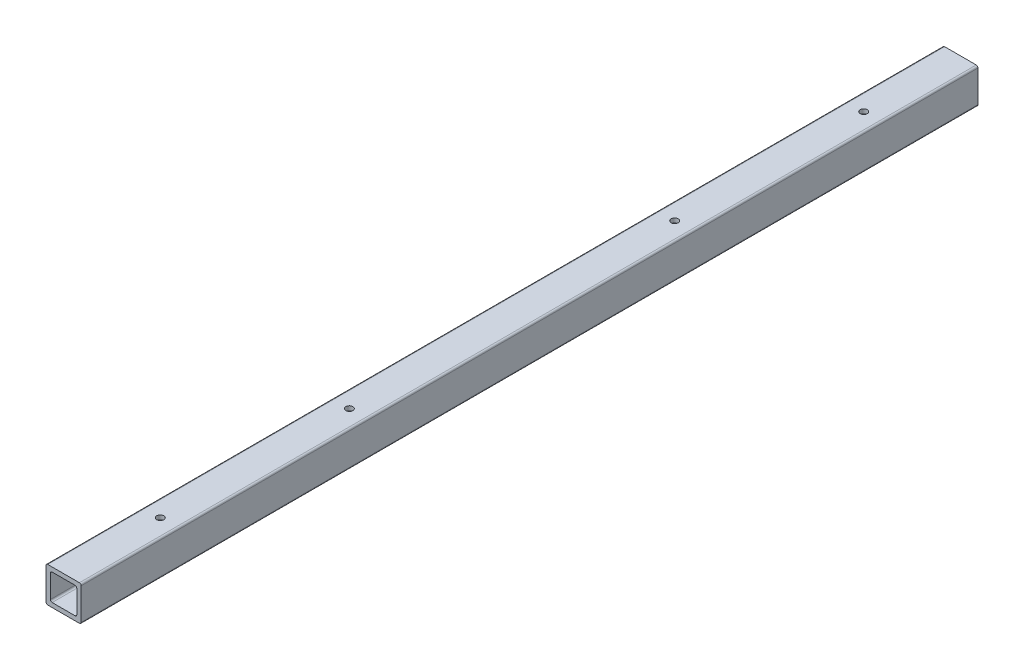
ISO-10303-21;
HEADER;
FILE_DESCRIPTION(('STEP AP214'),'2;1');
FILE_NAME('part.step','',(''),(''),'','','');
FILE_SCHEMA(('AUTOMOTIVE_DESIGN { 1 0 10303 214 1 1 1 1 }'));
ENDSEC;
DATA;
#1=APPLICATION_CONTEXT('core data for automotive mechanical design processes');
#2=APPLICATION_PROTOCOL_DEFINITION('international standard','automotive_design',2000,#1);
#3=PRODUCT_CONTEXT('',#1,'mechanical');
#4=PRODUCT('Part','Part','',(#3));
#5=PRODUCT_RELATED_PRODUCT_CATEGORY('part','',(#4));
#6=PRODUCT_DEFINITION_FORMATION('','',#4);
#7=PRODUCT_DEFINITION_CONTEXT('part definition',#1,'design');
#8=PRODUCT_DEFINITION('design','',#6,#7);
#9=PRODUCT_DEFINITION_SHAPE('','',#8);
#10=(LENGTH_UNIT() NAMED_UNIT(*) SI_UNIT(.MILLI.,.METRE.));
#11=(NAMED_UNIT(*) PLANE_ANGLE_UNIT() SI_UNIT($,.RADIAN.));
#12=(NAMED_UNIT(*) SI_UNIT($,.STERADIAN.) SOLID_ANGLE_UNIT());
#13=UNCERTAINTY_MEASURE_WITH_UNIT(LENGTH_MEASURE(1.E-05),#10,'distance_accuracy_value','');
#14=(GEOMETRIC_REPRESENTATION_CONTEXT(3) GLOBAL_UNCERTAINTY_ASSIGNED_CONTEXT((#13)) GLOBAL_UNIT_ASSIGNED_CONTEXT((#10,
#11,#12)) REPRESENTATION_CONTEXT('',''));
#15=CARTESIAN_POINT('',(0.,0.,0.));
#16=DIRECTION('',(0.,0.,1.));
#17=DIRECTION('',(1.,0.,0.));
#18=AXIS2_PLACEMENT_3D('',#15,#16,#17);
#19=CARTESIAN_POINT('',(-22.86,22.86,647.7));
#20=DIRECTION('',(0.,0.,-1.));
#21=DIRECTION('',(-1.,0.,0.));
#22=AXIS2_PLACEMENT_3D('',#19,#20,#21);
#23=PLANE('',#22);
#24=CARTESIAN_POINT('',(-22.86,22.86,647.7));
#25=DIRECTION('',(0.,0.,1.));
#26=DIRECTION('',(-1.,0.,0.));
#27=AXIS2_PLACEMENT_3D('',#24,#25,#26);
#28=CIRCLE('',#27,2.54);
#29=CARTESIAN_POINT('',(-22.86,25.4,647.7));
#30=VERTEX_POINT('',#29);
#31=CARTESIAN_POINT('',(-25.4,22.86,647.7));
#32=VERTEX_POINT('',#31);
#33=EDGE_CURVE('E236',#30,#32,#28,.T.);
#34=ORIENTED_EDGE('',*,*,#33,.T.);
#35=DIRECTION('',(0.,-1.,0.));
#36=VECTOR('',#35,1.);
#37=CARTESIAN_POINT('',(-25.4,-22.86,647.7));
#38=LINE('',#37,#36);
#39=CARTESIAN_POINT('',(-25.4,-22.86,647.7));
#40=VERTEX_POINT('',#39);
#41=EDGE_CURVE('E239',#32,#40,#38,.T.);
#42=ORIENTED_EDGE('',*,*,#41,.T.);
#43=CARTESIAN_POINT('',(-22.86,-22.86,647.7));
#44=DIRECTION('',(0.,0.,1.));
#45=DIRECTION('',(-1.,0.,0.));
#46=AXIS2_PLACEMENT_3D('',#43,#44,#45);
#47=CIRCLE('',#46,2.54);
#48=CARTESIAN_POINT('',(-22.86,-25.4,647.7));
#49=VERTEX_POINT('',#48);
#50=EDGE_CURVE('E241',#40,#49,#47,.T.);
#51=ORIENTED_EDGE('',*,*,#50,.T.);
#52=DIRECTION('',(1.,0.,0.));
#53=VECTOR('',#52,1.);
#54=CARTESIAN_POINT('',(-22.86,-25.4,647.7));
#55=LINE('',#54,#53);
#56=CARTESIAN_POINT('',(22.86,-25.4,647.7));
#57=VERTEX_POINT('',#56);
#58=EDGE_CURVE('E243',#49,#57,#55,.T.);
#59=ORIENTED_EDGE('',*,*,#58,.T.);
#60=CARTESIAN_POINT('',(22.86,-22.86,647.7));
#61=DIRECTION('',(0.,0.,1.));
#62=DIRECTION('',(-1.,0.,0.));
#63=AXIS2_PLACEMENT_3D('',#60,#61,#62);
#64=CIRCLE('',#63,2.54);
#65=CARTESIAN_POINT('',(25.4,-22.86,647.7));
#66=VERTEX_POINT('',#65);
#67=EDGE_CURVE('E245',#57,#66,#64,.T.);
#68=ORIENTED_EDGE('',*,*,#67,.T.);
#69=DIRECTION('',(0.,1.,0.));
#70=VECTOR('',#69,1.);
#71=CARTESIAN_POINT('',(25.4,-22.86,647.7));
#72=LINE('',#71,#70);
#73=CARTESIAN_POINT('',(25.4,22.86,647.7));
#74=VERTEX_POINT('',#73);
#75=EDGE_CURVE('E247',#66,#74,#72,.T.);
#76=ORIENTED_EDGE('',*,*,#75,.T.);
#77=CARTESIAN_POINT('',(22.86,22.86,647.7));
#78=DIRECTION('',(0.,0.,1.));
#79=DIRECTION('',(-1.,0.,0.));
#80=AXIS2_PLACEMENT_3D('',#77,#78,#79);
#81=CIRCLE('',#80,2.54);
#82=CARTESIAN_POINT('',(22.86,25.4,647.7));
#83=VERTEX_POINT('',#82);
#84=EDGE_CURVE('E249',#74,#83,#81,.T.);
#85=ORIENTED_EDGE('',*,*,#84,.T.);
#86=DIRECTION('',(-1.,0.,0.));
#87=VECTOR('',#86,1.);
#88=CARTESIAN_POINT('',(-22.86,25.4,647.7));
#89=LINE('',#88,#87);
#90=EDGE_CURVE('E251',#83,#30,#89,.T.);
#91=ORIENTED_EDGE('',*,*,#90,.T.);
#92=EDGE_LOOP('',(#34,#42,#51,#59,#68,#76,#85,#91));
#93=FACE_BOUND('',#92,.T.);
#94=CARTESIAN_POINT('',(16.51,16.51,647.7));
#95=DIRECTION('',(0.,0.,1.));
#96=DIRECTION('',(-1.,0.,0.));
#97=AXIS2_PLACEMENT_3D('',#94,#95,#96);
#98=CIRCLE('',#97,2.54);
#99=CARTESIAN_POINT('',(19.05,16.51,647.7));
#100=VERTEX_POINT('',#99);
#101=CARTESIAN_POINT('',(16.51,19.05,647.7));
#102=VERTEX_POINT('',#101);
#103=EDGE_CURVE('E166',#100,#102,#98,.T.);
#104=ORIENTED_EDGE('',*,*,#103,.F.);
#105=DIRECTION('',(0.,1.,0.));
#106=VECTOR('',#105,1.);
#107=CARTESIAN_POINT('',(19.05,-16.51,647.7));
#108=LINE('',#107,#106);
#109=CARTESIAN_POINT('',(19.05,-16.51,647.7));
#110=VERTEX_POINT('',#109);
#111=EDGE_CURVE('E206',#110,#100,#108,.T.);
#112=ORIENTED_EDGE('',*,*,#111,.F.);
#113=CARTESIAN_POINT('',(16.51,-16.51,647.7));
#114=DIRECTION('',(0.,0.,1.));
#115=DIRECTION('',(-1.,0.,0.));
#116=AXIS2_PLACEMENT_3D('',#113,#114,#115);
#117=CIRCLE('',#116,2.54);
#118=CARTESIAN_POINT('',(16.51,-19.05,647.7));
#119=VERTEX_POINT('',#118);
#120=EDGE_CURVE('E204',#119,#110,#117,.T.);
#121=ORIENTED_EDGE('',*,*,#120,.F.);
#122=DIRECTION('',(1.,0.,0.));
#123=VECTOR('',#122,1.);
#124=CARTESIAN_POINT('',(-16.51,-19.05,647.7));
#125=LINE('',#124,#123);
#126=CARTESIAN_POINT('',(-16.51,-19.05,647.7));
#127=VERTEX_POINT('',#126);
#128=EDGE_CURVE('E202',#127,#119,#125,.T.);
#129=ORIENTED_EDGE('',*,*,#128,.F.);
#130=CARTESIAN_POINT('',(-16.51,-16.51,647.7));
#131=DIRECTION('',(0.,0.,1.));
#132=DIRECTION('',(-1.,0.,0.));
#133=AXIS2_PLACEMENT_3D('',#130,#131,#132);
#134=CIRCLE('',#133,2.54);
#135=CARTESIAN_POINT('',(-19.05,-16.51,647.7));
#136=VERTEX_POINT('',#135);
#137=EDGE_CURVE('E200',#136,#127,#134,.T.);
#138=ORIENTED_EDGE('',*,*,#137,.F.);
#139=DIRECTION('',(0.,-1.,0.));
#140=VECTOR('',#139,1.);
#141=CARTESIAN_POINT('',(-19.05,-16.51,647.7));
#142=LINE('',#141,#140);
#143=CARTESIAN_POINT('',(-19.05,16.51,647.7));
#144=VERTEX_POINT('',#143);
#145=EDGE_CURVE('E198',#144,#136,#142,.T.);
#146=ORIENTED_EDGE('',*,*,#145,.F.);
#147=CARTESIAN_POINT('',(-16.51,16.51,647.7));
#148=DIRECTION('',(0.,0.,1.));
#149=DIRECTION('',(-1.,0.,0.));
#150=AXIS2_PLACEMENT_3D('',#147,#148,#149);
#151=CIRCLE('',#150,2.54);
#152=CARTESIAN_POINT('',(-16.51,19.05,647.7));
#153=VERTEX_POINT('',#152);
#154=EDGE_CURVE('E196',#153,#144,#151,.T.);
#155=ORIENTED_EDGE('',*,*,#154,.F.);
#156=DIRECTION('',(-1.,0.,0.));
#157=VECTOR('',#156,1.);
#158=CARTESIAN_POINT('',(-16.51,19.05,647.7));
#159=LINE('',#158,#157);
#160=EDGE_CURVE('E194',#102,#153,#159,.T.);
#161=ORIENTED_EDGE('',*,*,#160,.F.);
#162=EDGE_LOOP('',(#104,#112,#121,#129,#138,#146,#155,#161));
#163=FACE_BOUND('',#162,.T.);
#164=ADVANCED_FACE('F36',(#93,#163),#23,.F.);
#165=CARTESIAN_POINT('',(-22.86,22.86,-647.7));
#166=DIRECTION('',(0.,0.,-1.));
#167=DIRECTION('',(-1.,0.,0.));
#168=AXIS2_PLACEMENT_3D('',#165,#166,#167);
#169=PLANE('',#168);
#170=CARTESIAN_POINT('',(-22.86,22.86,-647.7));
#171=DIRECTION('',(0.,0.,1.));
#172=DIRECTION('',(-1.,0.,0.));
#173=AXIS2_PLACEMENT_3D('',#170,#171,#172);
#174=CIRCLE('',#173,2.54);
#175=CARTESIAN_POINT('',(-22.86,25.4,-647.7));
#176=VERTEX_POINT('',#175);
#177=CARTESIAN_POINT('',(-25.4,22.86,-647.7));
#178=VERTEX_POINT('',#177);
#179=EDGE_CURVE('E167',#176,#178,#174,.T.);
#180=ORIENTED_EDGE('',*,*,#179,.F.);
#181=DIRECTION('',(-1.,0.,0.));
#182=VECTOR('',#181,1.);
#183=CARTESIAN_POINT('',(-22.86,25.4,-647.7));
#184=LINE('',#183,#182);
#185=CARTESIAN_POINT('',(22.86,25.4,-647.7));
#186=VERTEX_POINT('',#185);
#187=EDGE_CURVE('E234',#186,#176,#184,.T.);
#188=ORIENTED_EDGE('',*,*,#187,.F.);
#189=CARTESIAN_POINT('',(22.86,22.86,-647.7));
#190=DIRECTION('',(0.,0.,1.));
#191=DIRECTION('',(-1.,0.,0.));
#192=AXIS2_PLACEMENT_3D('',#189,#190,#191);
#193=CIRCLE('',#192,2.54);
#194=CARTESIAN_POINT('',(25.4,22.86,-647.7));
#195=VERTEX_POINT('',#194);
#196=EDGE_CURVE('E232',#195,#186,#193,.T.);
#197=ORIENTED_EDGE('',*,*,#196,.F.);
#198=DIRECTION('',(0.,1.,0.));
#199=VECTOR('',#198,1.);
#200=CARTESIAN_POINT('',(25.4,-22.86,-647.7));
#201=LINE('',#200,#199);
#202=CARTESIAN_POINT('',(25.4,-22.86,-647.7));
#203=VERTEX_POINT('',#202);
#204=EDGE_CURVE('E230',#203,#195,#201,.T.);
#205=ORIENTED_EDGE('',*,*,#204,.F.);
#206=CARTESIAN_POINT('',(22.86,-22.86,-647.7));
#207=DIRECTION('',(0.,0.,1.));
#208=DIRECTION('',(-1.,0.,0.));
#209=AXIS2_PLACEMENT_3D('',#206,#207,#208);
#210=CIRCLE('',#209,2.54);
#211=CARTESIAN_POINT('',(22.86,-25.4,-647.7));
#212=VERTEX_POINT('',#211);
#213=EDGE_CURVE('E228',#212,#203,#210,.T.);
#214=ORIENTED_EDGE('',*,*,#213,.F.);
#215=DIRECTION('',(1.,0.,0.));
#216=VECTOR('',#215,1.);
#217=CARTESIAN_POINT('',(-22.86,-25.4,-647.7));
#218=LINE('',#217,#216);
#219=CARTESIAN_POINT('',(-22.86,-25.4,-647.7));
#220=VERTEX_POINT('',#219);
#221=EDGE_CURVE('E226',#220,#212,#218,.T.);
#222=ORIENTED_EDGE('',*,*,#221,.F.);
#223=CARTESIAN_POINT('',(-22.86,-22.86,-647.7));
#224=DIRECTION('',(0.,0.,1.));
#225=DIRECTION('',(-1.,0.,0.));
#226=AXIS2_PLACEMENT_3D('',#223,#224,#225);
#227=CIRCLE('',#226,2.54);
#228=CARTESIAN_POINT('',(-25.4,-22.86,-647.7));
#229=VERTEX_POINT('',#228);
#230=EDGE_CURVE('E224',#229,#220,#227,.T.);
#231=ORIENTED_EDGE('',*,*,#230,.F.);
#232=DIRECTION('',(0.,-1.,0.));
#233=VECTOR('',#232,1.);
#234=CARTESIAN_POINT('',(-25.4,-22.86,-647.7));
#235=LINE('',#234,#233);
#236=EDGE_CURVE('E222',#178,#229,#235,.T.);
#237=ORIENTED_EDGE('',*,*,#236,.F.);
#238=EDGE_LOOP('',(#180,#188,#197,#205,#214,#222,#231,#237));
#239=FACE_BOUND('',#238,.T.);
#240=DIRECTION('',(0.,1.,0.));
#241=VECTOR('',#240,1.);
#242=CARTESIAN_POINT('',(19.05,-16.51,-647.7));
#243=LINE('',#242,#241);
#244=CARTESIAN_POINT('',(19.05,-16.51,-647.7));
#245=VERTEX_POINT('',#244);
#246=CARTESIAN_POINT('',(19.05,16.51,-647.7));
#247=VERTEX_POINT('',#246);
#248=EDGE_CURVE('E172',#245,#247,#243,.T.);
#249=ORIENTED_EDGE('',*,*,#248,.T.);
#250=CARTESIAN_POINT('',(16.51,16.51,-647.7));
#251=DIRECTION('',(0.,0.,1.));
#252=DIRECTION('',(-1.,0.,0.));
#253=AXIS2_PLACEMENT_3D('',#250,#251,#252);
#254=CIRCLE('',#253,2.54);
#255=CARTESIAN_POINT('',(16.51,19.05,-647.7));
#256=VERTEX_POINT('',#255);
#257=EDGE_CURVE('E61',#247,#256,#254,.T.);
#258=ORIENTED_EDGE('',*,*,#257,.T.);
#259=DIRECTION('',(-1.,0.,0.));
#260=VECTOR('',#259,1.);
#261=CARTESIAN_POINT('',(-16.51,19.05,-647.7));
#262=LINE('',#261,#260);
#263=CARTESIAN_POINT('',(-16.51,19.05,-647.7));
#264=VERTEX_POINT('',#263);
#265=EDGE_CURVE('E153',#256,#264,#262,.T.);
#266=ORIENTED_EDGE('',*,*,#265,.T.);
#267=CARTESIAN_POINT('',(-16.51,16.51,-647.7));
#268=DIRECTION('',(0.,0.,1.));
#269=DIRECTION('',(-1.,0.,0.));
#270=AXIS2_PLACEMENT_3D('',#267,#268,#269);
#271=CIRCLE('',#270,2.54);
#272=CARTESIAN_POINT('',(-19.05,16.51,-647.7));
#273=VERTEX_POINT('',#272);
#274=EDGE_CURVE('E162',#264,#273,#271,.T.);
#275=ORIENTED_EDGE('',*,*,#274,.T.);
#276=DIRECTION('',(0.,-1.,0.));
#277=VECTOR('',#276,1.);
#278=CARTESIAN_POINT('',(-19.05,-16.51,-647.7));
#279=LINE('',#278,#277);
#280=CARTESIAN_POINT('',(-19.05,-16.51,-647.7));
#281=VERTEX_POINT('',#280);
#282=EDGE_CURVE('E181',#273,#281,#279,.T.);
#283=ORIENTED_EDGE('',*,*,#282,.T.);
#284=CARTESIAN_POINT('',(-16.51,-16.51,-647.7));
#285=DIRECTION('',(0.,0.,1.));
#286=DIRECTION('',(-1.,0.,0.));
#287=AXIS2_PLACEMENT_3D('',#284,#285,#286);
#288=CIRCLE('',#287,2.54);
#289=CARTESIAN_POINT('',(-16.51,-19.05,-647.7));
#290=VERTEX_POINT('',#289);
#291=EDGE_CURVE('E184',#281,#290,#288,.T.);
#292=ORIENTED_EDGE('',*,*,#291,.T.);
#293=DIRECTION('',(1.,0.,0.));
#294=VECTOR('',#293,1.);
#295=CARTESIAN_POINT('',(-16.51,-19.05,-647.7));
#296=LINE('',#295,#294);
#297=CARTESIAN_POINT('',(16.51,-19.05,-647.7));
#298=VERTEX_POINT('',#297);
#299=EDGE_CURVE('E187',#290,#298,#296,.T.);
#300=ORIENTED_EDGE('',*,*,#299,.T.);
#301=CARTESIAN_POINT('',(16.51,-16.51,-647.7));
#302=DIRECTION('',(0.,0.,1.));
#303=DIRECTION('',(-1.,0.,0.));
#304=AXIS2_PLACEMENT_3D('',#301,#302,#303);
#305=CIRCLE('',#304,2.54);
#306=EDGE_CURVE('E190',#298,#245,#305,.T.);
#307=ORIENTED_EDGE('',*,*,#306,.T.);
#308=EDGE_LOOP('',(#249,#258,#266,#275,#283,#292,#300,#307));
#309=FACE_BOUND('',#308,.T.);
#310=ADVANCED_FACE('F170',(#239,#309),#169,.T.);
#311=CARTESIAN_POINT('',(-22.86,22.86,647.7));
#312=DIRECTION('',(0.,0.,-1.));
#313=DIRECTION('',(-1.,0.,0.));
#314=AXIS2_PLACEMENT_3D('',#311,#312,#313);
#315=CYLINDRICAL_SURFACE('',#314,2.54);
#316=ORIENTED_EDGE('',*,*,#179,.T.);
#317=DIRECTION('',(0.,0.,-1.));
#318=VECTOR('',#317,1.);
#319=CARTESIAN_POINT('',(-25.4,22.86,647.7));
#320=LINE('',#319,#318);
#321=EDGE_CURVE('E11',#32,#178,#320,.T.);
#322=ORIENTED_EDGE('',*,*,#321,.F.);
#323=ORIENTED_EDGE('',*,*,#33,.F.);
#324=DIRECTION('',(0.,0.,-1.));
#325=VECTOR('',#324,1.);
#326=CARTESIAN_POINT('',(-22.86,25.4,647.7));
#327=LINE('',#326,#325);
#328=EDGE_CURVE('E253',#30,#176,#327,.T.);
#329=ORIENTED_EDGE('',*,*,#328,.T.);
#330=EDGE_LOOP('',(#316,#322,#323,#329));
#331=FACE_BOUND('',#330,.T.);
#332=ADVANCED_FACE('F38',(#331),#315,.T.);
#333=CARTESIAN_POINT('',(-25.4,-22.86,647.7));
#334=DIRECTION('',(1.,0.,0.));
#335=DIRECTION('',(0.,0.,-1.));
#336=AXIS2_PLACEMENT_3D('',#333,#334,#335);
#337=PLANE('',#336);
#338=ORIENTED_EDGE('',*,*,#236,.T.);
#339=DIRECTION('',(0.,0.,-1.));
#340=VECTOR('',#339,1.);
#341=CARTESIAN_POINT('',(-25.4,-22.86,647.7));
#342=LINE('',#341,#340);
#343=EDGE_CURVE('E45',#40,#229,#342,.T.);
#344=ORIENTED_EDGE('',*,*,#343,.F.);
#345=ORIENTED_EDGE('',*,*,#41,.F.);
#346=ORIENTED_EDGE('',*,*,#321,.T.);
#347=EDGE_LOOP('',(#338,#344,#345,#346));
#348=FACE_BOUND('',#347,.T.);
#349=ADVANCED_FACE('F360',(#348),#337,.F.);
#350=CARTESIAN_POINT('',(-22.86,-22.86,647.7));
#351=DIRECTION('',(0.,0.,-1.));
#352=DIRECTION('',(-1.,0.,0.));
#353=AXIS2_PLACEMENT_3D('',#350,#351,#352);
#354=CYLINDRICAL_SURFACE('',#353,2.54);
#355=ORIENTED_EDGE('',*,*,#230,.T.);
#356=DIRECTION('',(0.,0.,-1.));
#357=VECTOR('',#356,1.);
#358=CARTESIAN_POINT('',(-22.86,-25.4,647.7));
#359=LINE('',#358,#357);
#360=EDGE_CURVE('E268',#49,#220,#359,.T.);
#361=ORIENTED_EDGE('',*,*,#360,.F.);
#362=ORIENTED_EDGE('',*,*,#50,.F.);
#363=ORIENTED_EDGE('',*,*,#343,.T.);
#364=EDGE_LOOP('',(#355,#361,#362,#363));
#365=FACE_BOUND('',#364,.T.);
#366=ADVANCED_FACE('F357',(#365),#354,.T.);
#367=CARTESIAN_POINT('',(-22.86,-25.4,647.7));
#368=DIRECTION('',(0.,1.,0.));
#369=DIRECTION('',(0.,0.,1.));
#370=AXIS2_PLACEMENT_3D('',#367,#368,#369);
#371=PLANE('',#370);
#372=CARTESIAN_POINT('',(0.,-25.4,-508.));
#373=DIRECTION('',(0.,1.,0.));
#374=DIRECTION('',(-1.,0.,0.));
#375=AXIS2_PLACEMENT_3D('',#372,#373,#374);
#376=CIRCLE('',#375,5.08000000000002);
#377=CARTESIAN_POINT('',(-5.08000000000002,-25.4,-508.));
#378=VERTEX_POINT('',#377);
#379=EDGE_CURVE('E574',#378,#378,#376,.T.);
#380=ORIENTED_EDGE('',*,*,#379,.T.);
#381=EDGE_LOOP('',(#380));
#382=FACE_BOUND('',#381,.T.);
#383=CARTESIAN_POINT('',(0.,-25.4,508.));
#384=DIRECTION('',(0.,1.,0.));
#385=DIRECTION('',(-1.,0.,0.));
#386=AXIS2_PLACEMENT_3D('',#383,#384,#385);
#387=CIRCLE('',#386,5.08000000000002);
#388=CARTESIAN_POINT('',(-5.08000000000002,-25.4,508.));
#389=VERTEX_POINT('',#388);
#390=EDGE_CURVE('E283',#389,#389,#387,.T.);
#391=ORIENTED_EDGE('',*,*,#390,.T.);
#392=EDGE_LOOP('',(#391));
#393=FACE_BOUND('',#392,.T.);
#394=CARTESIAN_POINT('',(0.,-25.4,-234.95));
#395=DIRECTION('',(0.,1.,0.));
#396=DIRECTION('',(-1.,0.,0.));
#397=AXIS2_PLACEMENT_3D('',#394,#395,#396);
#398=CIRCLE('',#397,5.07999999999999);
#399=CARTESIAN_POINT('',(-5.07999999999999,-25.4,-234.95));
#400=VERTEX_POINT('',#399);
#401=EDGE_CURVE('E279',#400,#400,#398,.T.);
#402=ORIENTED_EDGE('',*,*,#401,.T.);
#403=EDGE_LOOP('',(#402));
#404=FACE_BOUND('',#403,.T.);
#405=CARTESIAN_POINT('',(0.,-25.4,234.95));
#406=DIRECTION('',(0.,1.,0.));
#407=DIRECTION('',(-1.,0.,0.));
#408=AXIS2_PLACEMENT_3D('',#405,#406,#407);
#409=CIRCLE('',#408,5.07999999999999);
#410=CARTESIAN_POINT('',(-5.07999999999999,-25.4,234.95));
#411=VERTEX_POINT('',#410);
#412=EDGE_CURVE('E275',#411,#411,#409,.T.);
#413=ORIENTED_EDGE('',*,*,#412,.T.);
#414=EDGE_LOOP('',(#413));
#415=FACE_BOUND('',#414,.T.);
#416=ORIENTED_EDGE('',*,*,#221,.T.);
#417=DIRECTION('',(0.,0.,-1.));
#418=VECTOR('',#417,1.);
#419=CARTESIAN_POINT('',(22.86,-25.4,647.7));
#420=LINE('',#419,#418);
#421=EDGE_CURVE('E265',#57,#212,#420,.T.);
#422=ORIENTED_EDGE('',*,*,#421,.F.);
#423=ORIENTED_EDGE('',*,*,#58,.F.);
#424=ORIENTED_EDGE('',*,*,#360,.T.);
#425=EDGE_LOOP('',(#416,#422,#423,#424));
#426=FACE_BOUND('',#425,.T.);
#427=ADVANCED_FACE('F310',(#382,#393,#404,#415,#426),#371,.F.);
#428=CARTESIAN_POINT('',(22.86,-22.86,647.7));
#429=DIRECTION('',(0.,0.,-1.));
#430=DIRECTION('',(-1.,0.,0.));
#431=AXIS2_PLACEMENT_3D('',#428,#429,#430);
#432=CYLINDRICAL_SURFACE('',#431,2.54);
#433=ORIENTED_EDGE('',*,*,#213,.T.);
#434=DIRECTION('',(0.,0.,-1.));
#435=VECTOR('',#434,1.);
#436=CARTESIAN_POINT('',(25.4,-22.86,647.7));
#437=LINE('',#436,#435);
#438=EDGE_CURVE('E262',#66,#203,#437,.T.);
#439=ORIENTED_EDGE('',*,*,#438,.F.);
#440=ORIENTED_EDGE('',*,*,#67,.F.);
#441=ORIENTED_EDGE('',*,*,#421,.T.);
#442=EDGE_LOOP('',(#433,#439,#440,#441));
#443=FACE_BOUND('',#442,.T.);
#444=ADVANCED_FACE('F350',(#443),#432,.T.);
#445=CARTESIAN_POINT('',(25.4,-22.86,647.7));
#446=DIRECTION('',(-1.,0.,0.));
#447=DIRECTION('',(0.,0.,1.));
#448=AXIS2_PLACEMENT_3D('',#445,#446,#447);
#449=PLANE('',#448);
#450=ORIENTED_EDGE('',*,*,#204,.T.);
#451=DIRECTION('',(0.,0.,-1.));
#452=VECTOR('',#451,1.);
#453=CARTESIAN_POINT('',(25.4,22.86,647.7));
#454=LINE('',#453,#452);
#455=EDGE_CURVE('E259',#74,#195,#454,.T.);
#456=ORIENTED_EDGE('',*,*,#455,.F.);
#457=ORIENTED_EDGE('',*,*,#75,.F.);
#458=ORIENTED_EDGE('',*,*,#438,.T.);
#459=EDGE_LOOP('',(#450,#456,#457,#458));
#460=FACE_BOUND('',#459,.T.);
#461=ADVANCED_FACE('F346',(#460),#449,.F.);
#462=CARTESIAN_POINT('',(22.86,22.86,647.7));
#463=DIRECTION('',(0.,0.,-1.));
#464=DIRECTION('',(-1.,0.,0.));
#465=AXIS2_PLACEMENT_3D('',#462,#463,#464);
#466=CYLINDRICAL_SURFACE('',#465,2.54);
#467=ORIENTED_EDGE('',*,*,#196,.T.);
#468=DIRECTION('',(0.,0.,-1.));
#469=VECTOR('',#468,1.);
#470=CARTESIAN_POINT('',(22.86,25.4,647.7));
#471=LINE('',#470,#469);
#472=EDGE_CURVE('E256',#83,#186,#471,.T.);
#473=ORIENTED_EDGE('',*,*,#472,.F.);
#474=ORIENTED_EDGE('',*,*,#84,.F.);
#475=ORIENTED_EDGE('',*,*,#455,.T.);
#476=EDGE_LOOP('',(#467,#473,#474,#475));
#477=FACE_BOUND('',#476,.T.);
#478=ADVANCED_FACE('F342',(#477),#466,.T.);
#479=CARTESIAN_POINT('',(-22.86,25.4,647.7));
#480=DIRECTION('',(0.,-1.,0.));
#481=DIRECTION('',(1.,0.,0.));
#482=AXIS2_PLACEMENT_3D('',#479,#480,#481);
#483=PLANE('',#482);
#484=CARTESIAN_POINT('',(0.,25.4,-508.));
#485=DIRECTION('',(0.,1.,0.));
#486=DIRECTION('',(-1.,0.,0.));
#487=AXIS2_PLACEMENT_3D('',#484,#485,#486);
#488=CIRCLE('',#487,5.08000000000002);
#489=CARTESIAN_POINT('',(-5.08000000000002,25.4,-508.));
#490=VERTEX_POINT('',#489);
#491=EDGE_CURVE('E573',#490,#490,#488,.T.);
#492=ORIENTED_EDGE('',*,*,#491,.F.);
#493=EDGE_LOOP('',(#492));
#494=FACE_BOUND('',#493,.T.);
#495=CARTESIAN_POINT('',(0.,25.4,508.));
#496=DIRECTION('',(0.,1.,0.));
#497=DIRECTION('',(-1.,0.,0.));
#498=AXIS2_PLACEMENT_3D('',#495,#496,#497);
#499=CIRCLE('',#498,5.08000000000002);
#500=CARTESIAN_POINT('',(-5.08000000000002,25.4,508.));
#501=VERTEX_POINT('',#500);
#502=EDGE_CURVE('E290',#501,#501,#499,.T.);
#503=ORIENTED_EDGE('',*,*,#502,.F.);
#504=EDGE_LOOP('',(#503));
#505=FACE_BOUND('',#504,.T.);
#506=CARTESIAN_POINT('',(0.,25.4,-234.95));
#507=DIRECTION('',(0.,1.,0.));
#508=DIRECTION('',(-1.,0.,0.));
#509=AXIS2_PLACEMENT_3D('',#506,#507,#508);
#510=CIRCLE('',#509,5.07999999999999);
#511=CARTESIAN_POINT('',(-5.07999999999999,25.4,-234.95));
#512=VERTEX_POINT('',#511);
#513=EDGE_CURVE('E287',#512,#512,#510,.T.);
#514=ORIENTED_EDGE('',*,*,#513,.F.);
#515=EDGE_LOOP('',(#514));
#516=FACE_BOUND('',#515,.T.);
#517=CARTESIAN_POINT('',(0.,25.4,234.95));
#518=DIRECTION('',(0.,1.,0.));
#519=DIRECTION('',(-1.,0.,0.));
#520=AXIS2_PLACEMENT_3D('',#517,#518,#519);
#521=CIRCLE('',#520,5.07999999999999);
#522=CARTESIAN_POINT('',(-5.07999999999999,25.4,234.95));
#523=VERTEX_POINT('',#522);
#524=EDGE_CURVE('E305',#523,#523,#521,.T.);
#525=ORIENTED_EDGE('',*,*,#524,.F.);
#526=EDGE_LOOP('',(#525));
#527=FACE_BOUND('',#526,.T.);
#528=ORIENTED_EDGE('',*,*,#187,.T.);
#529=ORIENTED_EDGE('',*,*,#328,.F.);
#530=ORIENTED_EDGE('',*,*,#90,.F.);
#531=ORIENTED_EDGE('',*,*,#472,.T.);
#532=EDGE_LOOP('',(#528,#529,#530,#531));
#533=FACE_BOUND('',#532,.T.);
#534=ADVANCED_FACE('F339',(#494,#505,#516,#527,#533),#483,.F.);
#535=CARTESIAN_POINT('',(16.51,16.51,647.7));
#536=DIRECTION('',(0.,0.,-1.));
#537=DIRECTION('',(-1.,0.,0.));
#538=AXIS2_PLACEMENT_3D('',#535,#536,#537);
#539=CYLINDRICAL_SURFACE('',#538,2.54);
#540=ORIENTED_EDGE('',*,*,#257,.F.);
#541=DIRECTION('',(0.,0.,-1.));
#542=VECTOR('',#541,1.);
#543=CARTESIAN_POINT('',(19.05,16.51,647.7));
#544=LINE('',#543,#542);
#545=EDGE_CURVE('E208',#100,#247,#544,.T.);
#546=ORIENTED_EDGE('',*,*,#545,.F.);
#547=ORIENTED_EDGE('',*,*,#103,.T.);
#548=DIRECTION('',(0.,0.,-1.));
#549=VECTOR('',#548,1.);
#550=CARTESIAN_POINT('',(16.51,19.05,647.7));
#551=LINE('',#550,#549);
#552=EDGE_CURVE('E155',#102,#256,#551,.T.);
#553=ORIENTED_EDGE('',*,*,#552,.T.);
#554=EDGE_LOOP('',(#540,#546,#547,#553));
#555=FACE_BOUND('',#554,.T.);
#556=ADVANCED_FACE('F164',(#555),#539,.F.);
#557=CARTESIAN_POINT('',(-16.51,19.05,647.7));
#558=DIRECTION('',(0.,-1.,0.));
#559=DIRECTION('',(0.,0.,-1.));
#560=AXIS2_PLACEMENT_3D('',#557,#558,#559);
#561=PLANE('',#560);
#562=CARTESIAN_POINT('',(0.,19.05,-508.));
#563=DIRECTION('',(0.,-1.,0.));
#564=DIRECTION('',(0.,0.,-1.));
#565=AXIS2_PLACEMENT_3D('',#562,#563,#564);
#566=CIRCLE('',#565,5.08000000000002);
#567=CARTESIAN_POINT('',(0.,19.05,-513.08));
#568=VERTEX_POINT('',#567);
#569=EDGE_CURVE('E295',#568,#568,#566,.T.);
#570=ORIENTED_EDGE('',*,*,#569,.F.);
#571=EDGE_LOOP('',(#570));
#572=FACE_BOUND('',#571,.T.);
#573=CARTESIAN_POINT('',(0.,19.05,508.));
#574=DIRECTION('',(0.,-1.,0.));
#575=DIRECTION('',(0.,0.,-1.));
#576=AXIS2_PLACEMENT_3D('',#573,#574,#575);
#577=CIRCLE('',#576,5.08000000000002);
#578=CARTESIAN_POINT('',(0.,19.05,502.92));
#579=VERTEX_POINT('',#578);
#580=EDGE_CURVE('E282',#579,#579,#577,.T.);
#581=ORIENTED_EDGE('',*,*,#580,.F.);
#582=EDGE_LOOP('',(#581));
#583=FACE_BOUND('',#582,.T.);
#584=CARTESIAN_POINT('',(0.,19.05,-234.95));
#585=DIRECTION('',(0.,-1.,0.));
#586=DIRECTION('',(0.,0.,-1.));
#587=AXIS2_PLACEMENT_3D('',#584,#585,#586);
#588=CIRCLE('',#587,5.07999999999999);
#589=CARTESIAN_POINT('',(0.,19.05,-240.03));
#590=VERTEX_POINT('',#589);
#591=EDGE_CURVE('E278',#590,#590,#588,.T.);
#592=ORIENTED_EDGE('',*,*,#591,.F.);
#593=EDGE_LOOP('',(#592));
#594=FACE_BOUND('',#593,.T.);
#595=CARTESIAN_POINT('',(0.,19.05,234.95));
#596=DIRECTION('',(0.,-1.,0.));
#597=DIRECTION('',(0.,0.,-1.));
#598=AXIS2_PLACEMENT_3D('',#595,#596,#597);
#599=CIRCLE('',#598,5.07999999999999);
#600=CARTESIAN_POINT('',(0.,19.05,229.87));
#601=VERTEX_POINT('',#600);
#602=EDGE_CURVE('E173',#601,#601,#599,.T.);
#603=ORIENTED_EDGE('',*,*,#602,.F.);
#604=EDGE_LOOP('',(#603));
#605=FACE_BOUND('',#604,.T.);
#606=ORIENTED_EDGE('',*,*,#265,.F.);
#607=ORIENTED_EDGE('',*,*,#552,.F.);
#608=ORIENTED_EDGE('',*,*,#160,.T.);
#609=DIRECTION('',(0.,0.,-1.));
#610=VECTOR('',#609,1.);
#611=CARTESIAN_POINT('',(-16.51,19.05,647.7));
#612=LINE('',#611,#610);
#613=EDGE_CURVE('E158',#153,#264,#612,.T.);
#614=ORIENTED_EDGE('',*,*,#613,.T.);
#615=EDGE_LOOP('',(#606,#607,#608,#614));
#616=FACE_BOUND('',#615,.T.);
#617=ADVANCED_FACE('F154',(#572,#583,#594,#605,#616),#561,.T.);
#618=CARTESIAN_POINT('',(-16.51,16.51,647.7));
#619=DIRECTION('',(0.,0.,-1.));
#620=DIRECTION('',(-1.,0.,0.));
#621=AXIS2_PLACEMENT_3D('',#618,#619,#620);
#622=CYLINDRICAL_SURFACE('',#621,2.54);
#623=ORIENTED_EDGE('',*,*,#274,.F.);
#624=ORIENTED_EDGE('',*,*,#613,.F.);
#625=ORIENTED_EDGE('',*,*,#154,.T.);
#626=DIRECTION('',(0.,0.,-1.));
#627=VECTOR('',#626,1.);
#628=CARTESIAN_POINT('',(-19.05,16.51,647.7));
#629=LINE('',#628,#627);
#630=EDGE_CURVE('E217',#144,#273,#629,.T.);
#631=ORIENTED_EDGE('',*,*,#630,.T.);
#632=EDGE_LOOP('',(#623,#624,#625,#631));
#633=FACE_BOUND('',#632,.T.);
#634=ADVANCED_FACE('F455',(#633),#622,.F.);
#635=CARTESIAN_POINT('',(-19.05,-16.51,647.7));
#636=DIRECTION('',(1.,0.,0.));
#637=DIRECTION('',(0.,0.,-1.));
#638=AXIS2_PLACEMENT_3D('',#635,#636,#637);
#639=PLANE('',#638);
#640=ORIENTED_EDGE('',*,*,#282,.F.);
#641=ORIENTED_EDGE('',*,*,#630,.F.);
#642=ORIENTED_EDGE('',*,*,#145,.T.);
#643=DIRECTION('',(0.,0.,-1.));
#644=VECTOR('',#643,1.);
#645=CARTESIAN_POINT('',(-19.05,-16.51,647.7));
#646=LINE('',#645,#644);
#647=EDGE_CURVE('E215',#136,#281,#646,.T.);
#648=ORIENTED_EDGE('',*,*,#647,.T.);
#649=EDGE_LOOP('',(#640,#641,#642,#648));
#650=FACE_BOUND('',#649,.T.);
#651=ADVANCED_FACE('F464',(#650),#639,.T.);
#652=CARTESIAN_POINT('',(-16.51,-16.51,647.7));
#653=DIRECTION('',(0.,0.,-1.));
#654=DIRECTION('',(-1.,0.,0.));
#655=AXIS2_PLACEMENT_3D('',#652,#653,#654);
#656=CYLINDRICAL_SURFACE('',#655,2.54);
#657=ORIENTED_EDGE('',*,*,#291,.F.);
#658=ORIENTED_EDGE('',*,*,#647,.F.);
#659=ORIENTED_EDGE('',*,*,#137,.T.);
#660=DIRECTION('',(0.,0.,-1.));
#661=VECTOR('',#660,1.);
#662=CARTESIAN_POINT('',(-16.51,-19.05,647.7));
#663=LINE('',#662,#661);
#664=EDGE_CURVE('E213',#127,#290,#663,.T.);
#665=ORIENTED_EDGE('',*,*,#664,.T.);
#666=EDGE_LOOP('',(#657,#658,#659,#665));
#667=FACE_BOUND('',#666,.T.);
#668=ADVANCED_FACE('F473',(#667),#656,.F.);
#669=CARTESIAN_POINT('',(-16.51,-19.05,647.7));
#670=DIRECTION('',(0.,1.,0.));
#671=DIRECTION('',(0.,0.,1.));
#672=AXIS2_PLACEMENT_3D('',#669,#670,#671);
#673=PLANE('',#672);
#674=CARTESIAN_POINT('',(0.,-19.05,-508.));
#675=DIRECTION('',(0.,1.,0.));
#676=DIRECTION('',(0.,0.,1.));
#677=AXIS2_PLACEMENT_3D('',#674,#675,#676);
#678=CIRCLE('',#677,5.08000000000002);
#679=CARTESIAN_POINT('',(0.,-19.05,-502.92));
#680=VERTEX_POINT('',#679);
#681=EDGE_CURVE('E40',#680,#680,#678,.T.);
#682=ORIENTED_EDGE('',*,*,#681,.F.);
#683=EDGE_LOOP('',(#682));
#684=FACE_BOUND('',#683,.T.);
#685=CARTESIAN_POINT('',(0.,-19.05,508.));
#686=DIRECTION('',(0.,1.,0.));
#687=DIRECTION('',(0.,0.,1.));
#688=AXIS2_PLACEMENT_3D('',#685,#686,#687);
#689=CIRCLE('',#688,5.08000000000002);
#690=CARTESIAN_POINT('',(0.,-19.05,513.08));
#691=VERTEX_POINT('',#690);
#692=EDGE_CURVE('E280',#691,#691,#689,.T.);
#693=ORIENTED_EDGE('',*,*,#692,.F.);
#694=EDGE_LOOP('',(#693));
#695=FACE_BOUND('',#694,.T.);
#696=CARTESIAN_POINT('',(0.,-19.05,-234.95));
#697=DIRECTION('',(0.,1.,0.));
#698=DIRECTION('',(0.,0.,1.));
#699=AXIS2_PLACEMENT_3D('',#696,#697,#698);
#700=CIRCLE('',#699,5.07999999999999);
#701=CARTESIAN_POINT('',(0.,-19.05,-229.87));
#702=VERTEX_POINT('',#701);
#703=EDGE_CURVE('E276',#702,#702,#700,.T.);
#704=ORIENTED_EDGE('',*,*,#703,.F.);
#705=EDGE_LOOP('',(#704));
#706=FACE_BOUND('',#705,.T.);
#707=CARTESIAN_POINT('',(0.,-19.05,234.95));
#708=DIRECTION('',(0.,1.,0.));
#709=DIRECTION('',(0.,0.,1.));
#710=AXIS2_PLACEMENT_3D('',#707,#708,#709);
#711=CIRCLE('',#710,5.07999999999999);
#712=CARTESIAN_POINT('',(0.,-19.05,240.03));
#713=VERTEX_POINT('',#712);
#714=EDGE_CURVE('E176',#713,#713,#711,.T.);
#715=ORIENTED_EDGE('',*,*,#714,.F.);
#716=EDGE_LOOP('',(#715));
#717=FACE_BOUND('',#716,.T.);
#718=ORIENTED_EDGE('',*,*,#299,.F.);
#719=ORIENTED_EDGE('',*,*,#664,.F.);
#720=ORIENTED_EDGE('',*,*,#128,.T.);
#721=DIRECTION('',(0.,0.,-1.));
#722=VECTOR('',#721,1.);
#723=CARTESIAN_POINT('',(16.51,-19.05,647.7));
#724=LINE('',#723,#722);
#725=EDGE_CURVE('E211',#119,#298,#724,.T.);
#726=ORIENTED_EDGE('',*,*,#725,.T.);
#727=EDGE_LOOP('',(#718,#719,#720,#726));
#728=FACE_BOUND('',#727,.T.);
#729=ADVANCED_FACE('F482',(#684,#695,#706,#717,#728),#673,.T.);
#730=CARTESIAN_POINT('',(16.51,-16.51,647.7));
#731=DIRECTION('',(0.,0.,-1.));
#732=DIRECTION('',(-1.,0.,0.));
#733=AXIS2_PLACEMENT_3D('',#730,#731,#732);
#734=CYLINDRICAL_SURFACE('',#733,2.54);
#735=ORIENTED_EDGE('',*,*,#306,.F.);
#736=ORIENTED_EDGE('',*,*,#725,.F.);
#737=ORIENTED_EDGE('',*,*,#120,.T.);
#738=DIRECTION('',(0.,0.,-1.));
#739=VECTOR('',#738,1.);
#740=CARTESIAN_POINT('',(19.05,-16.51,647.7));
#741=LINE('',#740,#739);
#742=EDGE_CURVE('E53',#110,#245,#741,.T.);
#743=ORIENTED_EDGE('',*,*,#742,.T.);
#744=EDGE_LOOP('',(#735,#736,#737,#743));
#745=FACE_BOUND('',#744,.T.);
#746=ADVANCED_FACE('F325',(#745),#734,.F.);
#747=CARTESIAN_POINT('',(19.05,-16.51,647.7));
#748=DIRECTION('',(-1.,0.,0.));
#749=DIRECTION('',(0.,0.,1.));
#750=AXIS2_PLACEMENT_3D('',#747,#748,#749);
#751=PLANE('',#750);
#752=ORIENTED_EDGE('',*,*,#248,.F.);
#753=ORIENTED_EDGE('',*,*,#742,.F.);
#754=ORIENTED_EDGE('',*,*,#111,.T.);
#755=ORIENTED_EDGE('',*,*,#545,.T.);
#756=EDGE_LOOP('',(#752,#753,#754,#755));
#757=FACE_BOUND('',#756,.T.);
#758=ADVANCED_FACE('F316',(#757),#751,.T.);
#759=CARTESIAN_POINT('',(0.,-25.4,234.95));
#760=DIRECTION('',(0.,1.,0.));
#761=DIRECTION('',(-1.,0.,0.));
#762=AXIS2_PLACEMENT_3D('',#759,#760,#761);
#763=CYLINDRICAL_SURFACE('',#762,5.07999999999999);
#764=ORIENTED_EDGE('',*,*,#714,.T.);
#765=EDGE_LOOP('',(#764));
#766=FACE_BOUND('',#765,.T.);
#767=ORIENTED_EDGE('',*,*,#412,.F.);
#768=EDGE_LOOP('',(#767));
#769=FACE_BOUND('',#768,.T.);
#770=ADVANCED_FACE('F313',(#766,#769),#763,.F.);
#771=ORIENTED_EDGE('',*,*,#602,.T.);
#772=EDGE_LOOP('',(#771));
#773=FACE_BOUND('',#772,.T.);
#774=ORIENTED_EDGE('',*,*,#524,.T.);
#775=EDGE_LOOP('',(#774));
#776=FACE_BOUND('',#775,.T.);
#777=ADVANCED_FACE('F315',(#773,#776),#763,.F.);
#778=CARTESIAN_POINT('',(0.,-25.4,-234.95));
#779=DIRECTION('',(0.,1.,0.));
#780=DIRECTION('',(-1.,0.,0.));
#781=AXIS2_PLACEMENT_3D('',#778,#779,#780);
#782=CYLINDRICAL_SURFACE('',#781,5.07999999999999);
#783=ORIENTED_EDGE('',*,*,#703,.T.);
#784=EDGE_LOOP('',(#783));
#785=FACE_BOUND('',#784,.T.);
#786=ORIENTED_EDGE('',*,*,#401,.F.);
#787=EDGE_LOOP('',(#786));
#788=FACE_BOUND('',#787,.T.);
#789=ADVANCED_FACE('F323',(#785,#788),#782,.F.);
#790=ORIENTED_EDGE('',*,*,#591,.T.);
#791=EDGE_LOOP('',(#790));
#792=FACE_BOUND('',#791,.T.);
#793=ORIENTED_EDGE('',*,*,#513,.T.);
#794=EDGE_LOOP('',(#793));
#795=FACE_BOUND('',#794,.T.);
#796=ADVANCED_FACE('F519',(#792,#795),#782,.F.);
#797=CARTESIAN_POINT('',(0.,-25.4,508.));
#798=DIRECTION('',(0.,1.,0.));
#799=DIRECTION('',(-1.,0.,0.));
#800=AXIS2_PLACEMENT_3D('',#797,#798,#799);
#801=CYLINDRICAL_SURFACE('',#800,5.08000000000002);
#802=ORIENTED_EDGE('',*,*,#692,.T.);
#803=EDGE_LOOP('',(#802));
#804=FACE_BOUND('',#803,.T.);
#805=ORIENTED_EDGE('',*,*,#390,.F.);
#806=EDGE_LOOP('',(#805));
#807=FACE_BOUND('',#806,.T.);
#808=ADVANCED_FACE('F527',(#804,#807),#801,.F.);
#809=ORIENTED_EDGE('',*,*,#580,.T.);
#810=EDGE_LOOP('',(#809));
#811=FACE_BOUND('',#810,.T.);
#812=ORIENTED_EDGE('',*,*,#502,.T.);
#813=EDGE_LOOP('',(#812));
#814=FACE_BOUND('',#813,.T.);
#815=ADVANCED_FACE('F535',(#811,#814),#801,.F.);
#816=CARTESIAN_POINT('',(0.,-25.4,-508.));
#817=DIRECTION('',(0.,1.,0.));
#818=DIRECTION('',(-1.,0.,0.));
#819=AXIS2_PLACEMENT_3D('',#816,#817,#818);
#820=CYLINDRICAL_SURFACE('',#819,5.08000000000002);
#821=ORIENTED_EDGE('',*,*,#681,.T.);
#822=EDGE_LOOP('',(#821));
#823=FACE_BOUND('',#822,.T.);
#824=ORIENTED_EDGE('',*,*,#379,.F.);
#825=EDGE_LOOP('',(#824));
#826=FACE_BOUND('',#825,.T.);
#827=ADVANCED_FACE('F543',(#823,#826),#820,.F.);
#828=ORIENTED_EDGE('',*,*,#569,.T.);
#829=EDGE_LOOP('',(#828));
#830=FACE_BOUND('',#829,.T.);
#831=ORIENTED_EDGE('',*,*,#491,.T.);
#832=EDGE_LOOP('',(#831));
#833=FACE_BOUND('',#832,.T.);
#834=ADVANCED_FACE('F551',(#830,#833),#820,.F.);
#835=CLOSED_SHELL('',(#164,#310,#332,#349,#366,#427,#444,#461,#478,#534,#556,#617,#634,#651,
#668,#729,#746,#758,#770,#777,#789,#796,#808,#815,#827,#834));
#836=MANIFOLD_SOLID_BREP('B2',#835);
#837=ADVANCED_BREP_SHAPE_REPRESENTATION('',(#18,#836),#14);
#838=SHAPE_DEFINITION_REPRESENTATION(#9,#837);
ENDSEC;
END-ISO-10303-21;
